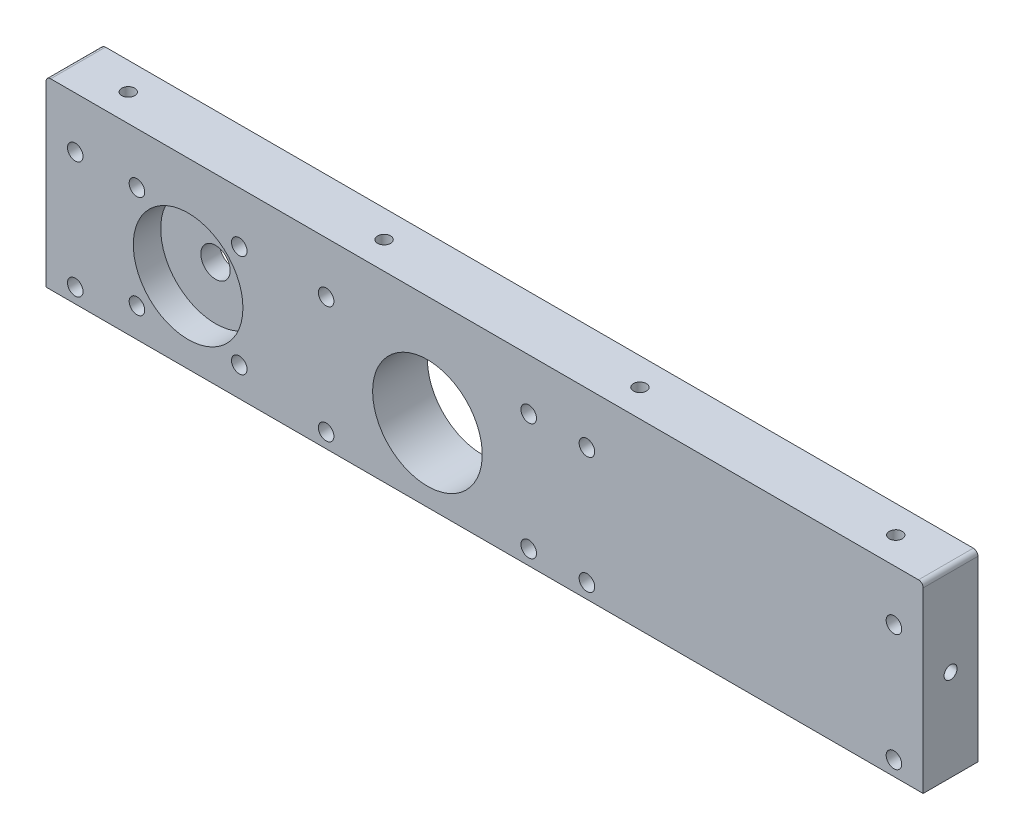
from build123d import *

# Parameters (mm, degrees)
EXTRUDE1_DEPTH      = 9.525
SKETCH39_R          = 9.525
CUT_EXTRUDE1_DEPTH  = 9.525
SKETCH35_R          = 2.5527
CUT_EXTRUDE2_DEPTH  = 4.7625
SKETCH40_R          = 2.0193
CUT_EXTRUDE3_DEPTH  = 15.875
SKETCH41_R          = 1.35255
CUT_EXTRUDE4_DEPTH  = 154.981362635
SKETCH43_R          = 1.1303
CUT_EXTRUDE5_DEPTH  = 9.525
CUT_EXTRUDE6_START  = -9.525
SKETCH44_R          = 1.1303
CUT_EXTRUDE6_DEPTH  = 9.525
SKETCH46_R          = 9.525
CUT_EXTRUDE7_DEPTH  = 4.7625
SKETCH47_R          = 4.7625
CUT_EXTRUDE8_DEPTH  = 1.524
SKETCH48_R          = 1.1303
CUT_EXTRUDE9_DEPTH  = 156.963291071
SKETCH49_R          = 1.35255
CUT_EXTRUDE10_DEPTH = 154.981362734
SKETCH50_R          = 1.35255
CUT_EXTRUDE11_DEPTH = 154.981362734


with BuildPart() as part:
    # Sketch34 → Extrude1 (new body)
    with BuildSketch(Plane.XY):
        with BuildLine():
            Line((0, -11.90625), (152.4, -11.90625))
            Line((152.4, -11.90625), (152.4, 19.03095))
            ThreePointArc((152.4, 19.03095), (152.161936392, 19.605686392), (151.5872, 19.84375))
            Line((151.5872, 19.84375), (0.8128, 19.84375))
            ThreePointArc((0.8128, 19.84375), (0.238063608, 19.605686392), (0, 19.03095))
            Line((0, 19.03095), (0, -11.90625))
        make_face()
    extrude(amount=EXTRUDE1_DEPTH)

    # Sketch39 → Cut-Extrude1 (cut)
    with BuildSketch(Plane(origin=(0, 0, 0), x_dir=(-1, 0, 0), z_dir=(0, 0, -1))):
        with Locations((-66.2686, 0.79375)):
            Circle(SKETCH39_R)
    extrude(amount=-CUT_EXTRUDE1_DEPTH, mode=Mode.SUBTRACT)

    # Sketch35 → Cut-Extrude2 (cut)
    with BuildSketch(Plane.XY):
        with Locations(Location((24.6888, 1.7907, 0), (0, 0, 180))):
            Circle(SKETCH35_R)
    extrude(amount=CUT_EXTRUDE2_DEPTH, mode=Mode.SUBTRACT)

    # Sketch40 → Cut-Extrude3 (cut)
    with BuildSketch(Plane.XZ.offset(11.90625)):
        with Locations(Location((9.525, 4.7625, 0), (0, 0, 270))):
            Circle(SKETCH40_R)
        with Locations(Location((53.975, 4.7625, 0), (0, 0, 270))):
            Circle(SKETCH40_R)
        with Locations(Location((98.425, 4.7625, 0), (0, 0, 270))):
            Circle(SKETCH40_R)
        with Locations(Location((142.875, 4.7625, 0), (0, 0, 270))):
            Circle(SKETCH40_R)
    extrude(amount=-CUT_EXTRUDE3_DEPTH, mode=Mode.SUBTRACT)

    # Sketch41 → Cut-Extrude4 (cut, through all)
    with BuildSketch(Plane.XY.offset(9.525)):
        with Locations((48.670963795, -9.36625)):
            Circle(SKETCH41_R)
        with Locations((48.670963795, 10.95375)):
            Circle(SKETCH41_R)
        with Locations((83.866236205, 10.95375)):
            Circle(SKETCH41_R)
        with Locations((83.866236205, -9.36625)):
            Circle(SKETCH41_R)
    extrude(amount=-CUT_EXTRUDE4_DEPTH, mode=Mode.SUBTRACT)

    # Sketch43 → Cut-Extrude5 (cut)
    with BuildSketch(Plane(origin=(152.4, 0, 0), x_dir=(0, 0, -1), z_dir=(1, 0, 0))):
        with Locations((-4.7625, 3.96875)):
            Circle(SKETCH43_R)
    extrude(amount=-CUT_EXTRUDE5_DEPTH, mode=Mode.SUBTRACT)

    # Sketch44 → Cut-Extrude6 (cut)
    with BuildSketch(Plane.ZY.offset(CUT_EXTRUDE6_START)):
        with Locations(Location((4.7625, 3.96875, 0), (0, 0, 180))):
            Circle(SKETCH44_R)
    extrude(amount=CUT_EXTRUDE6_DEPTH, mode=Mode.SUBTRACT)

    # Sketch46 → Cut-Extrude7 (cut)
    with BuildSketch(Plane.XY.offset(9.525)):
        with Locations((24.6888, 2.0701)):
            Circle(SKETCH46_R)
    extrude(amount=-CUT_EXTRUDE7_DEPTH, mode=Mode.SUBTRACT)

    # Sketch47 → Cut-Extrude8 (cut)
    with BuildSketch(Plane(origin=(0, 0, 0), x_dir=(-1, 0, 0), z_dir=(0, 0, -1))):
        with Locations((-24.6888, 1.7907)):
            Circle(SKETCH47_R)
    extrude(amount=-CUT_EXTRUDE8_DEPTH, mode=Mode.SUBTRACT)

    # Sketch48 → Cut-Extrude9 (cut, through all)
    with BuildSketch(Plane(origin=(0, 19.84375, 0), x_dir=(-1, 0, 0), z_dir=(0, 1, 0))):
        with Locations(Location((-9.525, 4.7625, 0), (0, 0, 90))):
            Circle(SKETCH48_R)
        with Locations(Location((-53.975, 4.7625, 0), (0, 0, 90))):
            Circle(SKETCH48_R)
        with Locations(Location((-98.425, 4.7625, 0), (0, 0, 90))):
            Circle(SKETCH48_R)
        with Locations(Location((-142.875, 4.7625, 0), (0, 0, 90))):
            Circle(SKETCH48_R)
    extrude(amount=-CUT_EXTRUDE9_DEPTH, mode=Mode.SUBTRACT)

    # Sketch49 → Cut-Extrude10 (cut, through all)
    with BuildSketch(Plane.XY.offset(9.525)):
        with Locations((15.7988, 10.9601)):
            Circle(SKETCH49_R)
        with Locations((33.5788, 10.9601)):
            Circle(SKETCH49_R)
        with Locations((33.5788, -6.8199)):
            Circle(SKETCH49_R)
        with Locations((15.7988, -6.8199)):
            Circle(SKETCH49_R)
    extrude(amount=-CUT_EXTRUDE10_DEPTH, mode=Mode.SUBTRACT)

    # Sketch50 → Cut-Extrude11 (cut, through all)
    with BuildSketch(Plane.XY.offset(9.525)):
        with Locations((5.08, 10.95375)):
            Circle(SKETCH50_R)
        with Locations((147.32, -9.36625)):
            Circle(SKETCH50_R)
        with Locations((5.08, -9.36625)):
            Circle(SKETCH50_R)
        with Locations((147.32, 10.95375)):
            Circle(SKETCH50_R)
        with Locations((93.98, 10.95375)):
            Circle(SKETCH50_R)
        with Locations((93.98, -9.36625)):
            Circle(SKETCH50_R)
    extrude(amount=-CUT_EXTRUDE11_DEPTH, mode=Mode.SUBTRACT)


solid = part.part
